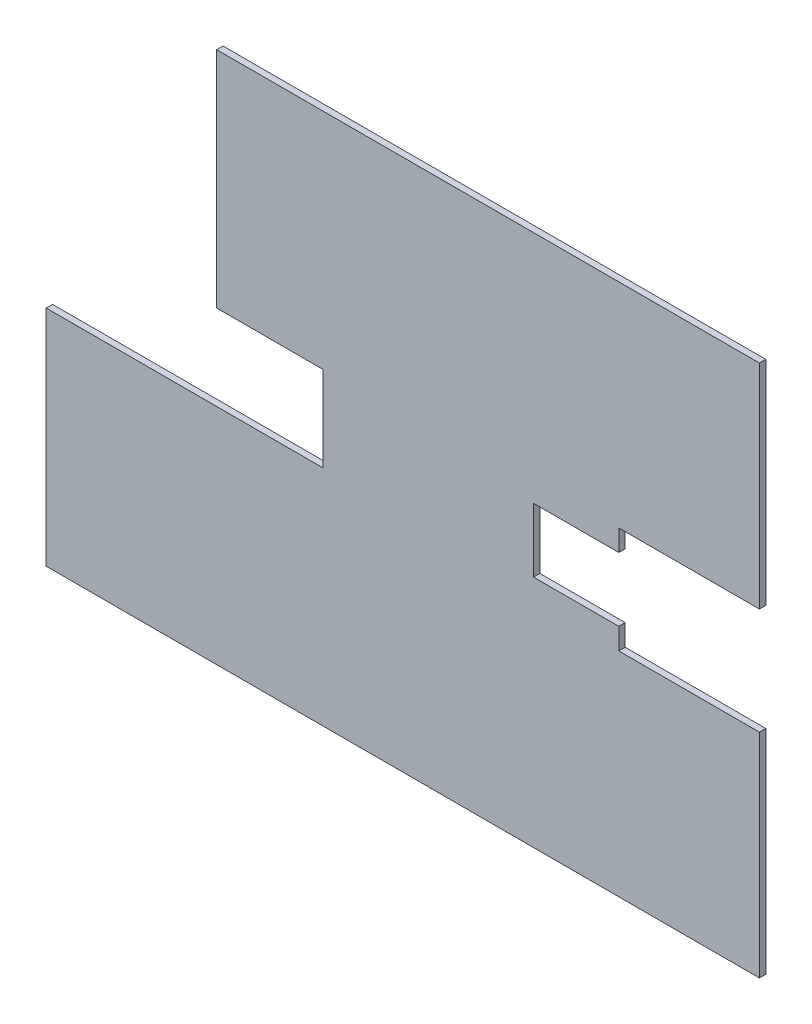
ISO-10303-21;
HEADER;
FILE_DESCRIPTION(('STEP AP214'),'2;1');
FILE_NAME('part.step','',(''),(''),'','','');
FILE_SCHEMA(('AUTOMOTIVE_DESIGN { 1 0 10303 214 1 1 1 1 }'));
ENDSEC;
DATA;
#1=APPLICATION_CONTEXT('core data for automotive mechanical design processes');
#2=APPLICATION_PROTOCOL_DEFINITION('international standard','automotive_design',2000,#1);
#3=PRODUCT_CONTEXT('',#1,'mechanical');
#4=PRODUCT('Part','Part','',(#3));
#5=PRODUCT_RELATED_PRODUCT_CATEGORY('part','',(#4));
#6=PRODUCT_DEFINITION_FORMATION('','',#4);
#7=PRODUCT_DEFINITION_CONTEXT('part definition',#1,'design');
#8=PRODUCT_DEFINITION('design','',#6,#7);
#9=PRODUCT_DEFINITION_SHAPE('','',#8);
#10=(LENGTH_UNIT() NAMED_UNIT(*) SI_UNIT(.MILLI.,.METRE.));
#11=(NAMED_UNIT(*) PLANE_ANGLE_UNIT() SI_UNIT($,.RADIAN.));
#12=(NAMED_UNIT(*) SI_UNIT($,.STERADIAN.) SOLID_ANGLE_UNIT());
#13=UNCERTAINTY_MEASURE_WITH_UNIT(LENGTH_MEASURE(1.E-05),#10,'distance_accuracy_value','');
#14=(GEOMETRIC_REPRESENTATION_CONTEXT(3) GLOBAL_UNCERTAINTY_ASSIGNED_CONTEXT((#13)) GLOBAL_UNIT_ASSIGNED_CONTEXT((#10,
#11,#12)) REPRESENTATION_CONTEXT('',''));
#15=CARTESIAN_POINT('',(0.,0.,0.));
#16=DIRECTION('',(0.,0.,1.));
#17=DIRECTION('',(1.,0.,0.));
#18=AXIS2_PLACEMENT_3D('',#15,#16,#17);
#19=CARTESIAN_POINT('',(167.393841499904,25.,3.));
#20=DIRECTION('',(-1.,0.,0.));
#21=DIRECTION('',(0.,0.,1.));
#22=AXIS2_PLACEMENT_3D('',#19,#20,#21);
#23=PLANE('',#22);
#24=DIRECTION('',(0.,1.,0.));
#25=VECTOR('',#24,1.);
#26=CARTESIAN_POINT('',(167.393841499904,25.,0.));
#27=LINE('',#26,#25);
#28=CARTESIAN_POINT('',(167.393841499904,25.,0.));
#29=VERTEX_POINT('',#28);
#30=CARTESIAN_POINT('',(167.393841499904,125.,0.));
#31=VERTEX_POINT('',#30);
#32=EDGE_CURVE('E183',#29,#31,#27,.T.);
#33=ORIENTED_EDGE('',*,*,#32,.T.);
#34=DIRECTION('',(0.,0.,-1.));
#35=VECTOR('',#34,1.);
#36=CARTESIAN_POINT('',(167.393841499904,125.,3.));
#37=LINE('',#36,#35);
#38=CARTESIAN_POINT('',(167.393841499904,125.,3.));
#39=VERTEX_POINT('',#38);
#40=EDGE_CURVE('E11',#39,#31,#37,.T.);
#41=ORIENTED_EDGE('',*,*,#40,.F.);
#42=DIRECTION('',(0.,1.,0.));
#43=VECTOR('',#42,1.);
#44=CARTESIAN_POINT('',(167.393841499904,25.,3.));
#45=LINE('',#44,#43);
#46=CARTESIAN_POINT('',(167.393841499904,25.,3.));
#47=VERTEX_POINT('',#46);
#48=EDGE_CURVE('E213',#47,#39,#45,.T.);
#49=ORIENTED_EDGE('',*,*,#48,.F.);
#50=DIRECTION('',(0.,0.,-1.));
#51=VECTOR('',#50,1.);
#52=CARTESIAN_POINT('',(167.393841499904,25.,3.));
#53=LINE('',#52,#51);
#54=EDGE_CURVE('E179',#47,#29,#53,.T.);
#55=ORIENTED_EDGE('',*,*,#54,.T.);
#56=EDGE_LOOP('',(#33,#41,#49,#55));
#57=FACE_BOUND('',#56,.T.);
#58=ADVANCED_FACE('F39',(#57),#23,.F.);
#59=CARTESIAN_POINT('',(-87.287619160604,125.,3.));
#60=DIRECTION('',(0.,-1.,0.));
#61=DIRECTION('',(0.,0.,-1.));
#62=AXIS2_PLACEMENT_3D('',#59,#60,#61);
#63=PLANE('',#62);
#64=DIRECTION('',(-1.,0.,0.));
#65=VECTOR('',#64,1.);
#66=CARTESIAN_POINT('',(-87.287619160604,125.,0.));
#67=LINE('',#66,#65);
#68=CARTESIAN_POINT('',(-87.287619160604,125.,0.));
#69=VERTEX_POINT('',#68);
#70=EDGE_CURVE('E186',#31,#69,#67,.T.);
#71=ORIENTED_EDGE('',*,*,#70,.T.);
#72=DIRECTION('',(0.,0.,-1.));
#73=VECTOR('',#72,1.);
#74=CARTESIAN_POINT('',(-87.287619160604,125.,3.));
#75=LINE('',#74,#73);
#76=CARTESIAN_POINT('',(-87.287619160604,125.,3.));
#77=VERTEX_POINT('',#76);
#78=EDGE_CURVE('E47',#77,#69,#75,.T.);
#79=ORIENTED_EDGE('',*,*,#78,.F.);
#80=DIRECTION('',(-1.,0.,0.));
#81=VECTOR('',#80,1.);
#82=CARTESIAN_POINT('',(-87.287619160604,125.,3.));
#83=LINE('',#82,#81);
#84=EDGE_CURVE('E122',#39,#77,#83,.T.);
#85=ORIENTED_EDGE('',*,*,#84,.F.);
#86=ORIENTED_EDGE('',*,*,#40,.T.);
#87=EDGE_LOOP('',(#71,#79,#85,#86));
#88=FACE_BOUND('',#87,.T.);
#89=ADVANCED_FACE('F311',(#88),#63,.F.);
#90=CARTESIAN_POINT('',(-87.287619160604,20.,3.));
#91=DIRECTION('',(1.,0.,0.));
#92=DIRECTION('',(0.,0.,-1.));
#93=AXIS2_PLACEMENT_3D('',#90,#91,#92);
#94=PLANE('',#93);
#95=DIRECTION('',(0.,-1.,0.));
#96=VECTOR('',#95,1.);
#97=CARTESIAN_POINT('',(-87.287619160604,20.,0.));
#98=LINE('',#97,#96);
#99=CARTESIAN_POINT('',(-87.287619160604,20.,0.));
#100=VERTEX_POINT('',#99);
#101=EDGE_CURVE('E188',#69,#100,#98,.T.);
#102=ORIENTED_EDGE('',*,*,#101,.T.);
#103=DIRECTION('',(0.,0.,-1.));
#104=VECTOR('',#103,1.);
#105=CARTESIAN_POINT('',(-87.287619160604,20.,3.));
#106=LINE('',#105,#104);
#107=CARTESIAN_POINT('',(-87.287619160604,20.,3.));
#108=VERTEX_POINT('',#107);
#109=EDGE_CURVE('E244',#108,#100,#106,.T.);
#110=ORIENTED_EDGE('',*,*,#109,.F.);
#111=DIRECTION('',(0.,-1.,0.));
#112=VECTOR('',#111,1.);
#113=CARTESIAN_POINT('',(-87.287619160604,20.,3.));
#114=LINE('',#113,#112);
#115=EDGE_CURVE('E252',#77,#108,#114,.T.);
#116=ORIENTED_EDGE('',*,*,#115,.F.);
#117=ORIENTED_EDGE('',*,*,#78,.T.);
#118=EDGE_LOOP('',(#102,#110,#116,#117));
#119=FACE_BOUND('',#118,.T.);
#120=ADVANCED_FACE('F250',(#119),#94,.F.);
#121=CARTESIAN_POINT('',(-87.287619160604,20.,3.));
#122=DIRECTION('',(0.,1.,0.));
#123=DIRECTION('',(0.,0.,1.));
#124=AXIS2_PLACEMENT_3D('',#121,#122,#123);
#125=PLANE('',#124);
#126=DIRECTION('',(1.,0.,0.));
#127=VECTOR('',#126,1.);
#128=CARTESIAN_POINT('',(-87.287619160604,20.,0.));
#129=LINE('',#128,#127);
#130=CARTESIAN_POINT('',(-37.287619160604,20.,0.));
#131=VERTEX_POINT('',#130);
#132=EDGE_CURVE('E190',#100,#131,#129,.T.);
#133=ORIENTED_EDGE('',*,*,#132,.T.);
#134=DIRECTION('',(0.,0.,-1.));
#135=VECTOR('',#134,1.);
#136=CARTESIAN_POINT('',(-37.287619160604,20.,3.));
#137=LINE('',#136,#135);
#138=CARTESIAN_POINT('',(-37.287619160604,20.,3.));
#139=VERTEX_POINT('',#138);
#140=EDGE_CURVE('E241',#139,#131,#137,.T.);
#141=ORIENTED_EDGE('',*,*,#140,.F.);
#142=DIRECTION('',(1.,0.,0.));
#143=VECTOR('',#142,1.);
#144=CARTESIAN_POINT('',(-87.287619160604,20.,3.));
#145=LINE('',#144,#143);
#146=EDGE_CURVE('E270',#108,#139,#145,.T.);
#147=ORIENTED_EDGE('',*,*,#146,.F.);
#148=ORIENTED_EDGE('',*,*,#109,.T.);
#149=EDGE_LOOP('',(#133,#141,#147,#148));
#150=FACE_BOUND('',#149,.T.);
#151=ADVANCED_FACE('F261',(#150),#125,.F.);
#152=CARTESIAN_POINT('',(-37.287619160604,-20.,3.));
#153=DIRECTION('',(1.,0.,0.));
#154=DIRECTION('',(0.,0.,-1.));
#155=AXIS2_PLACEMENT_3D('',#152,#153,#154);
#156=PLANE('',#155);
#157=DIRECTION('',(0.,-1.,0.));
#158=VECTOR('',#157,1.);
#159=CARTESIAN_POINT('',(-37.287619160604,-20.,0.));
#160=LINE('',#159,#158);
#161=CARTESIAN_POINT('',(-37.287619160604,-20.,0.));
#162=VERTEX_POINT('',#161);
#163=EDGE_CURVE('E192',#131,#162,#160,.T.);
#164=ORIENTED_EDGE('',*,*,#163,.T.);
#165=DIRECTION('',(0.,0.,-1.));
#166=VECTOR('',#165,1.);
#167=CARTESIAN_POINT('',(-37.287619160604,-20.,3.));
#168=LINE('',#167,#166);
#169=CARTESIAN_POINT('',(-37.287619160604,-20.,3.));
#170=VERTEX_POINT('',#169);
#171=EDGE_CURVE('E238',#170,#162,#168,.T.);
#172=ORIENTED_EDGE('',*,*,#171,.F.);
#173=DIRECTION('',(0.,-1.,0.));
#174=VECTOR('',#173,1.);
#175=CARTESIAN_POINT('',(-37.287619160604,-20.,3.));
#176=LINE('',#175,#174);
#177=EDGE_CURVE('E267',#139,#170,#176,.T.);
#178=ORIENTED_EDGE('',*,*,#177,.F.);
#179=ORIENTED_EDGE('',*,*,#140,.T.);
#180=EDGE_LOOP('',(#164,#172,#178,#179));
#181=FACE_BOUND('',#180,.T.);
#182=ADVANCED_FACE('F265',(#181),#156,.F.);
#183=CARTESIAN_POINT('',(-167.287619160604,-20.,3.));
#184=DIRECTION('',(0.,-1.,0.));
#185=DIRECTION('',(0.,0.,-1.));
#186=AXIS2_PLACEMENT_3D('',#183,#184,#185);
#187=PLANE('',#186);
#188=DIRECTION('',(-1.,0.,0.));
#189=VECTOR('',#188,1.);
#190=CARTESIAN_POINT('',(-167.287619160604,-20.,0.));
#191=LINE('',#190,#189);
#192=CARTESIAN_POINT('',(-167.287619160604,-20.,0.));
#193=VERTEX_POINT('',#192);
#194=EDGE_CURVE('E194',#162,#193,#191,.T.);
#195=ORIENTED_EDGE('',*,*,#194,.T.);
#196=DIRECTION('',(0.,0.,-1.));
#197=VECTOR('',#196,1.);
#198=CARTESIAN_POINT('',(-167.287619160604,-20.,3.));
#199=LINE('',#198,#197);
#200=CARTESIAN_POINT('',(-167.287619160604,-20.,3.));
#201=VERTEX_POINT('',#200);
#202=EDGE_CURVE('E235',#201,#193,#199,.T.);
#203=ORIENTED_EDGE('',*,*,#202,.F.);
#204=DIRECTION('',(-1.,0.,0.));
#205=VECTOR('',#204,1.);
#206=CARTESIAN_POINT('',(-167.287619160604,-20.,3.));
#207=LINE('',#206,#205);
#208=EDGE_CURVE('E269',#170,#201,#207,.T.);
#209=ORIENTED_EDGE('',*,*,#208,.F.);
#210=ORIENTED_EDGE('',*,*,#171,.T.);
#211=EDGE_LOOP('',(#195,#203,#209,#210));
#212=FACE_BOUND('',#211,.T.);
#213=ADVANCED_FACE('F324',(#212),#187,.F.);
#214=CARTESIAN_POINT('',(-167.287619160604,-124.920679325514,3.));
#215=DIRECTION('',(1.,0.,0.));
#216=DIRECTION('',(0.,0.,-1.));
#217=AXIS2_PLACEMENT_3D('',#214,#215,#216);
#218=PLANE('',#217);
#219=DIRECTION('',(0.,-1.,0.));
#220=VECTOR('',#219,1.);
#221=CARTESIAN_POINT('',(-167.287619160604,-124.920679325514,0.));
#222=LINE('',#221,#220);
#223=CARTESIAN_POINT('',(-167.287619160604,-124.920679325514,0.));
#224=VERTEX_POINT('',#223);
#225=EDGE_CURVE('E196',#193,#224,#222,.T.);
#226=ORIENTED_EDGE('',*,*,#225,.T.);
#227=DIRECTION('',(0.,0.,-1.));
#228=VECTOR('',#227,1.);
#229=CARTESIAN_POINT('',(-167.287619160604,-124.920679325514,3.));
#230=LINE('',#229,#228);
#231=CARTESIAN_POINT('',(-167.287619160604,-124.920679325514,3.));
#232=VERTEX_POINT('',#231);
#233=EDGE_CURVE('E232',#232,#224,#230,.T.);
#234=ORIENTED_EDGE('',*,*,#233,.F.);
#235=DIRECTION('',(0.,-1.,0.));
#236=VECTOR('',#235,1.);
#237=CARTESIAN_POINT('',(-167.287619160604,-124.920679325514,3.));
#238=LINE('',#237,#236);
#239=EDGE_CURVE('E272',#201,#232,#238,.T.);
#240=ORIENTED_EDGE('',*,*,#239,.F.);
#241=ORIENTED_EDGE('',*,*,#202,.T.);
#242=EDGE_LOOP('',(#226,#234,#240,#241));
#243=FACE_BOUND('',#242,.T.);
#244=ADVANCED_FACE('F327',(#243),#218,.F.);
#245=CARTESIAN_POINT('',(-167.287619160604,-124.920679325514,3.));
#246=DIRECTION('',(0.,1.,0.));
#247=DIRECTION('',(0.,0.,1.));
#248=AXIS2_PLACEMENT_3D('',#245,#246,#247);
#249=PLANE('',#248);
#250=DIRECTION('',(1.,0.,0.));
#251=VECTOR('',#250,1.);
#252=CARTESIAN_POINT('',(-167.287619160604,-124.920679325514,0.));
#253=LINE('',#252,#251);
#254=CARTESIAN_POINT('',(167.393841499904,-124.920679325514,0.));
#255=VERTEX_POINT('',#254);
#256=EDGE_CURVE('E198',#224,#255,#253,.T.);
#257=ORIENTED_EDGE('',*,*,#256,.T.);
#258=DIRECTION('',(0.,0.,-1.));
#259=VECTOR('',#258,1.);
#260=CARTESIAN_POINT('',(167.393841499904,-124.920679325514,3.));
#261=LINE('',#260,#259);
#262=CARTESIAN_POINT('',(167.393841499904,-124.920679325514,3.));
#263=VERTEX_POINT('',#262);
#264=EDGE_CURVE('E229',#263,#255,#261,.T.);
#265=ORIENTED_EDGE('',*,*,#264,.F.);
#266=DIRECTION('',(1.,0.,0.));
#267=VECTOR('',#266,1.);
#268=CARTESIAN_POINT('',(-167.287619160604,-124.920679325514,3.));
#269=LINE('',#268,#267);
#270=EDGE_CURVE('E278',#232,#263,#269,.T.);
#271=ORIENTED_EDGE('',*,*,#270,.F.);
#272=ORIENTED_EDGE('',*,*,#233,.T.);
#273=EDGE_LOOP('',(#257,#265,#271,#272));
#274=FACE_BOUND('',#273,.T.);
#275=ADVANCED_FACE('F331',(#274),#249,.F.);
#276=CARTESIAN_POINT('',(167.393841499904,-124.920679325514,3.));
#277=DIRECTION('',(-1.,0.,0.));
#278=DIRECTION('',(0.,0.,1.));
#279=AXIS2_PLACEMENT_3D('',#276,#277,#278);
#280=PLANE('',#279);
#281=DIRECTION('',(0.,1.,0.));
#282=VECTOR('',#281,1.);
#283=CARTESIAN_POINT('',(167.393841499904,-124.920679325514,0.));
#284=LINE('',#283,#282);
#285=CARTESIAN_POINT('',(167.393841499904,-25.,0.));
#286=VERTEX_POINT('',#285);
#287=EDGE_CURVE('E200',#255,#286,#284,.T.);
#288=ORIENTED_EDGE('',*,*,#287,.T.);
#289=DIRECTION('',(0.,0.,-1.));
#290=VECTOR('',#289,1.);
#291=CARTESIAN_POINT('',(167.393841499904,-25.,3.));
#292=LINE('',#291,#290);
#293=CARTESIAN_POINT('',(167.393841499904,-25.,3.));
#294=VERTEX_POINT('',#293);
#295=EDGE_CURVE('E226',#294,#286,#292,.T.);
#296=ORIENTED_EDGE('',*,*,#295,.F.);
#297=DIRECTION('',(0.,1.,0.));
#298=VECTOR('',#297,1.);
#299=CARTESIAN_POINT('',(167.393841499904,-124.920679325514,3.));
#300=LINE('',#299,#298);
#301=EDGE_CURVE('E280',#263,#294,#300,.T.);
#302=ORIENTED_EDGE('',*,*,#301,.F.);
#303=ORIENTED_EDGE('',*,*,#264,.T.);
#304=EDGE_LOOP('',(#288,#296,#302,#303));
#305=FACE_BOUND('',#304,.T.);
#306=ADVANCED_FACE('F335',(#305),#280,.F.);
#307=CARTESIAN_POINT('',(167.393841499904,-25.,3.));
#308=DIRECTION('',(0.,-1.,0.));
#309=DIRECTION('',(1.,0.,0.));
#310=AXIS2_PLACEMENT_3D('',#307,#308,#309);
#311=PLANE('',#310);
#312=DIRECTION('',(-1.,0.,0.));
#313=VECTOR('',#312,1.);
#314=CARTESIAN_POINT('',(167.393841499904,-25.,0.));
#315=LINE('',#314,#313);
#316=CARTESIAN_POINT('',(101.393841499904,-25.,0.));
#317=VERTEX_POINT('',#316);
#318=EDGE_CURVE('E202',#286,#317,#315,.T.);
#319=ORIENTED_EDGE('',*,*,#318,.T.);
#320=DIRECTION('',(0.,0.,-1.));
#321=VECTOR('',#320,1.);
#322=CARTESIAN_POINT('',(101.393841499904,-25.,3.));
#323=LINE('',#322,#321);
#324=CARTESIAN_POINT('',(101.393841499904,-25.,3.));
#325=VERTEX_POINT('',#324);
#326=EDGE_CURVE('E223',#325,#317,#323,.T.);
#327=ORIENTED_EDGE('',*,*,#326,.F.);
#328=DIRECTION('',(-1.,0.,0.));
#329=VECTOR('',#328,1.);
#330=CARTESIAN_POINT('',(167.393841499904,-25.,3.));
#331=LINE('',#330,#329);
#332=EDGE_CURVE('E282',#294,#325,#331,.T.);
#333=ORIENTED_EDGE('',*,*,#332,.F.);
#334=ORIENTED_EDGE('',*,*,#295,.T.);
#335=EDGE_LOOP('',(#319,#327,#333,#334));
#336=FACE_BOUND('',#335,.T.);
#337=ADVANCED_FACE('F339',(#336),#311,.F.);
#338=CARTESIAN_POINT('',(101.393841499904,-15.,3.));
#339=DIRECTION('',(-1.,0.,0.));
#340=DIRECTION('',(0.,0.,1.));
#341=AXIS2_PLACEMENT_3D('',#338,#339,#340);
#342=PLANE('',#341);
#343=DIRECTION('',(0.,1.,0.));
#344=VECTOR('',#343,1.);
#345=CARTESIAN_POINT('',(101.393841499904,-15.,0.));
#346=LINE('',#345,#344);
#347=CARTESIAN_POINT('',(101.393841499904,-15.,0.));
#348=VERTEX_POINT('',#347);
#349=EDGE_CURVE('E204',#317,#348,#346,.T.);
#350=ORIENTED_EDGE('',*,*,#349,.T.);
#351=DIRECTION('',(0.,0.,-1.));
#352=VECTOR('',#351,1.);
#353=CARTESIAN_POINT('',(101.393841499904,-15.,3.));
#354=LINE('',#353,#352);
#355=CARTESIAN_POINT('',(101.393841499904,-15.,3.));
#356=VERTEX_POINT('',#355);
#357=EDGE_CURVE('E220',#356,#348,#354,.T.);
#358=ORIENTED_EDGE('',*,*,#357,.F.);
#359=DIRECTION('',(0.,1.,0.));
#360=VECTOR('',#359,1.);
#361=CARTESIAN_POINT('',(101.393841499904,-15.,3.));
#362=LINE('',#361,#360);
#363=EDGE_CURVE('E284',#325,#356,#362,.T.);
#364=ORIENTED_EDGE('',*,*,#363,.F.);
#365=ORIENTED_EDGE('',*,*,#326,.T.);
#366=EDGE_LOOP('',(#350,#358,#364,#365));
#367=FACE_BOUND('',#366,.T.);
#368=ADVANCED_FACE('F343',(#367),#342,.F.);
#369=CARTESIAN_POINT('',(101.393841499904,-15.,3.));
#370=DIRECTION('',(0.,-1.,0.));
#371=DIRECTION('',(1.,0.,0.));
#372=AXIS2_PLACEMENT_3D('',#369,#370,#371);
#373=PLANE('',#372);
#374=DIRECTION('',(-1.,0.,0.));
#375=VECTOR('',#374,1.);
#376=CARTESIAN_POINT('',(101.393841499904,-15.,0.));
#377=LINE('',#376,#375);
#378=CARTESIAN_POINT('',(61.3938414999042,-15.,0.));
#379=VERTEX_POINT('',#378);
#380=EDGE_CURVE('E206',#348,#379,#377,.T.);
#381=ORIENTED_EDGE('',*,*,#380,.T.);
#382=DIRECTION('',(0.,0.,-1.));
#383=VECTOR('',#382,1.);
#384=CARTESIAN_POINT('',(61.3938414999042,-15.,3.));
#385=LINE('',#384,#383);
#386=CARTESIAN_POINT('',(61.3938414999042,-15.,3.));
#387=VERTEX_POINT('',#386);
#388=EDGE_CURVE('E217',#387,#379,#385,.T.);
#389=ORIENTED_EDGE('',*,*,#388,.F.);
#390=DIRECTION('',(-1.,0.,0.));
#391=VECTOR('',#390,1.);
#392=CARTESIAN_POINT('',(101.393841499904,-15.,3.));
#393=LINE('',#392,#391);
#394=EDGE_CURVE('E286',#356,#387,#393,.T.);
#395=ORIENTED_EDGE('',*,*,#394,.F.);
#396=ORIENTED_EDGE('',*,*,#357,.T.);
#397=EDGE_LOOP('',(#381,#389,#395,#396));
#398=FACE_BOUND('',#397,.T.);
#399=ADVANCED_FACE('F292',(#398),#373,.F.);
#400=CARTESIAN_POINT('',(61.3938414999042,15.,3.));
#401=DIRECTION('',(-1.,0.,0.));
#402=DIRECTION('',(0.,-1.,0.));
#403=AXIS2_PLACEMENT_3D('',#400,#401,#402);
#404=PLANE('',#403);
#405=DIRECTION('',(0.,1.,0.));
#406=VECTOR('',#405,1.);
#407=CARTESIAN_POINT('',(61.3938414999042,15.,0.));
#408=LINE('',#407,#406);
#409=CARTESIAN_POINT('',(61.3938414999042,15.,0.));
#410=VERTEX_POINT('',#409);
#411=EDGE_CURVE('E208',#379,#410,#408,.T.);
#412=ORIENTED_EDGE('',*,*,#411,.T.);
#413=DIRECTION('',(0.,0.,-1.));
#414=VECTOR('',#413,1.);
#415=CARTESIAN_POINT('',(61.3938414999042,15.,3.));
#416=LINE('',#415,#414);
#417=CARTESIAN_POINT('',(61.3938414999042,15.,3.));
#418=VERTEX_POINT('',#417);
#419=EDGE_CURVE('E174',#418,#410,#416,.T.);
#420=ORIENTED_EDGE('',*,*,#419,.F.);
#421=DIRECTION('',(0.,1.,0.));
#422=VECTOR('',#421,1.);
#423=CARTESIAN_POINT('',(61.3938414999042,15.,3.));
#424=LINE('',#423,#422);
#425=EDGE_CURVE('E165',#387,#418,#424,.T.);
#426=ORIENTED_EDGE('',*,*,#425,.F.);
#427=ORIENTED_EDGE('',*,*,#388,.T.);
#428=EDGE_LOOP('',(#412,#420,#426,#427));
#429=FACE_BOUND('',#428,.T.);
#430=ADVANCED_FACE('F296',(#429),#404,.F.);
#431=CARTESIAN_POINT('',(101.393841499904,15.,3.));
#432=DIRECTION('',(0.,1.,0.));
#433=DIRECTION('',(-1.,0.,0.));
#434=AXIS2_PLACEMENT_3D('',#431,#432,#433);
#435=PLANE('',#434);
#436=DIRECTION('',(1.,0.,0.));
#437=VECTOR('',#436,1.);
#438=CARTESIAN_POINT('',(101.393841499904,15.,0.));
#439=LINE('',#438,#437);
#440=CARTESIAN_POINT('',(101.393841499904,15.,0.));
#441=VERTEX_POINT('',#440);
#442=EDGE_CURVE('E173',#410,#441,#439,.T.);
#443=ORIENTED_EDGE('',*,*,#442,.T.);
#444=DIRECTION('',(0.,0.,-1.));
#445=VECTOR('',#444,1.);
#446=CARTESIAN_POINT('',(101.393841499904,15.,3.));
#447=LINE('',#446,#445);
#448=CARTESIAN_POINT('',(101.393841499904,15.,3.));
#449=VERTEX_POINT('',#448);
#450=EDGE_CURVE('E170',#449,#441,#447,.T.);
#451=ORIENTED_EDGE('',*,*,#450,.F.);
#452=DIRECTION('',(1.,0.,0.));
#453=VECTOR('',#452,1.);
#454=CARTESIAN_POINT('',(101.393841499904,15.,3.));
#455=LINE('',#454,#453);
#456=EDGE_CURVE('E159',#418,#449,#455,.T.);
#457=ORIENTED_EDGE('',*,*,#456,.F.);
#458=ORIENTED_EDGE('',*,*,#419,.T.);
#459=EDGE_LOOP('',(#443,#451,#457,#458));
#460=FACE_BOUND('',#459,.T.);
#461=ADVANCED_FACE('F171',(#460),#435,.F.);
#462=CARTESIAN_POINT('',(101.393841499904,25.,3.));
#463=DIRECTION('',(-1.,0.,0.));
#464=DIRECTION('',(0.,-1.,0.));
#465=AXIS2_PLACEMENT_3D('',#462,#463,#464);
#466=PLANE('',#465);
#467=DIRECTION('',(0.,1.,0.));
#468=VECTOR('',#467,1.);
#469=CARTESIAN_POINT('',(101.393841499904,25.,0.));
#470=LINE('',#469,#468);
#471=CARTESIAN_POINT('',(101.393841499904,25.,0.));
#472=VERTEX_POINT('',#471);
#473=EDGE_CURVE('E108',#441,#472,#470,.T.);
#474=ORIENTED_EDGE('',*,*,#473,.T.);
#475=DIRECTION('',(0.,0.,-1.));
#476=VECTOR('',#475,1.);
#477=CARTESIAN_POINT('',(101.393841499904,25.,3.));
#478=LINE('',#477,#476);
#479=CARTESIAN_POINT('',(101.393841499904,25.,3.));
#480=VERTEX_POINT('',#479);
#481=EDGE_CURVE('E175',#480,#472,#478,.T.);
#482=ORIENTED_EDGE('',*,*,#481,.F.);
#483=DIRECTION('',(0.,1.,0.));
#484=VECTOR('',#483,1.);
#485=CARTESIAN_POINT('',(101.393841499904,25.,3.));
#486=LINE('',#485,#484);
#487=EDGE_CURVE('E163',#449,#480,#486,.T.);
#488=ORIENTED_EDGE('',*,*,#487,.F.);
#489=ORIENTED_EDGE('',*,*,#450,.T.);
#490=EDGE_LOOP('',(#474,#482,#488,#489));
#491=FACE_BOUND('',#490,.T.);
#492=ADVANCED_FACE('F177',(#491),#466,.F.);
#493=CARTESIAN_POINT('',(167.393841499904,25.,3.));
#494=DIRECTION('',(0.,1.,0.));
#495=DIRECTION('',(-1.,0.,0.));
#496=AXIS2_PLACEMENT_3D('',#493,#494,#495);
#497=PLANE('',#496);
#498=DIRECTION('',(1.,0.,0.));
#499=VECTOR('',#498,1.);
#500=CARTESIAN_POINT('',(167.393841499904,25.,0.));
#501=LINE('',#500,#499);
#502=EDGE_CURVE('E114',#472,#29,#501,.T.);
#503=ORIENTED_EDGE('',*,*,#502,.T.);
#504=ORIENTED_EDGE('',*,*,#54,.F.);
#505=DIRECTION('',(1.,0.,0.));
#506=VECTOR('',#505,1.);
#507=CARTESIAN_POINT('',(167.393841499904,25.,3.));
#508=LINE('',#507,#506);
#509=EDGE_CURVE('E55',#480,#47,#508,.T.);
#510=ORIENTED_EDGE('',*,*,#509,.F.);
#511=ORIENTED_EDGE('',*,*,#481,.T.);
#512=EDGE_LOOP('',(#503,#504,#510,#511));
#513=FACE_BOUND('',#512,.T.);
#514=ADVANCED_FACE('F300',(#513),#497,.F.);
#515=CARTESIAN_POINT('',(0.,0.,3.));
#516=DIRECTION('',(0.,0.,-1.));
#517=DIRECTION('',(-1.,0.,0.));
#518=AXIS2_PLACEMENT_3D('',#515,#516,#517);
#519=PLANE('',#518);
#520=ORIENTED_EDGE('',*,*,#48,.T.);
#521=ORIENTED_EDGE('',*,*,#84,.T.);
#522=ORIENTED_EDGE('',*,*,#115,.T.);
#523=ORIENTED_EDGE('',*,*,#146,.T.);
#524=ORIENTED_EDGE('',*,*,#177,.T.);
#525=ORIENTED_EDGE('',*,*,#208,.T.);
#526=ORIENTED_EDGE('',*,*,#239,.T.);
#527=ORIENTED_EDGE('',*,*,#270,.T.);
#528=ORIENTED_EDGE('',*,*,#301,.T.);
#529=ORIENTED_EDGE('',*,*,#332,.T.);
#530=ORIENTED_EDGE('',*,*,#363,.T.);
#531=ORIENTED_EDGE('',*,*,#394,.T.);
#532=ORIENTED_EDGE('',*,*,#425,.T.);
#533=ORIENTED_EDGE('',*,*,#456,.T.);
#534=ORIENTED_EDGE('',*,*,#487,.T.);
#535=ORIENTED_EDGE('',*,*,#509,.T.);
#536=EDGE_LOOP('',(#520,#521,#522,#523,#524,#525,#526,#527,#528,#529,#530,#531,#532,#533,#534,#535));
#537=FACE_BOUND('',#536,.T.);
#538=ADVANCED_FACE('F161',(#537),#519,.F.);
#539=CARTESIAN_POINT('',(0.,0.,0.));
#540=DIRECTION('',(0.,0.,-1.));
#541=DIRECTION('',(-1.,0.,0.));
#542=AXIS2_PLACEMENT_3D('',#539,#540,#541);
#543=PLANE('',#542);
#544=ORIENTED_EDGE('',*,*,#32,.F.);
#545=ORIENTED_EDGE('',*,*,#502,.F.);
#546=ORIENTED_EDGE('',*,*,#473,.F.);
#547=ORIENTED_EDGE('',*,*,#442,.F.);
#548=ORIENTED_EDGE('',*,*,#411,.F.);
#549=ORIENTED_EDGE('',*,*,#380,.F.);
#550=ORIENTED_EDGE('',*,*,#349,.F.);
#551=ORIENTED_EDGE('',*,*,#318,.F.);
#552=ORIENTED_EDGE('',*,*,#287,.F.);
#553=ORIENTED_EDGE('',*,*,#256,.F.);
#554=ORIENTED_EDGE('',*,*,#225,.F.);
#555=ORIENTED_EDGE('',*,*,#194,.F.);
#556=ORIENTED_EDGE('',*,*,#163,.F.);
#557=ORIENTED_EDGE('',*,*,#132,.F.);
#558=ORIENTED_EDGE('',*,*,#101,.F.);
#559=ORIENTED_EDGE('',*,*,#70,.F.);
#560=EDGE_LOOP('',(#544,#545,#546,#547,#548,#549,#550,#551,#552,#553,#554,#555,#556,#557,#558,#559));
#561=FACE_BOUND('',#560,.T.);
#562=ADVANCED_FACE('F256',(#561),#543,.T.);
#563=CLOSED_SHELL('',(#58,#89,#120,#151,#182,#213,#244,#275,#306,#337,#368,#399,#430,#461,#492,
#514,#538,#562));
#564=MANIFOLD_SOLID_BREP('B2',#563);
#565=ADVANCED_BREP_SHAPE_REPRESENTATION('',(#18,#564),#14);
#566=SHAPE_DEFINITION_REPRESENTATION(#9,#565);
ENDSEC;
END-ISO-10303-21;
